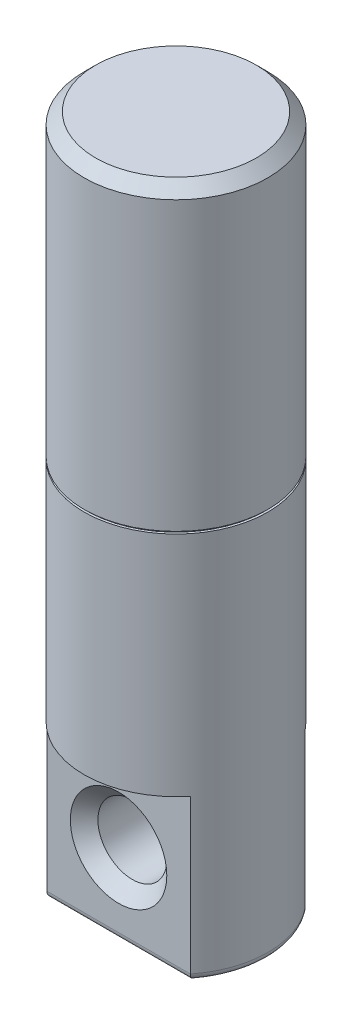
ISO-10303-21;
HEADER;
FILE_DESCRIPTION(('STEP AP214'),'2;1');
FILE_NAME('part.step','',(''),(''),'','','');
FILE_SCHEMA(('AUTOMOTIVE_DESIGN { 1 0 10303 214 1 1 1 1 }'));
ENDSEC;
DATA;
#1=APPLICATION_CONTEXT('core data for automotive mechanical design processes');
#2=APPLICATION_PROTOCOL_DEFINITION('international standard','automotive_design',2000,#1);
#3=PRODUCT_CONTEXT('',#1,'mechanical');
#4=PRODUCT('Part','Part','',(#3));
#5=PRODUCT_RELATED_PRODUCT_CATEGORY('part','',(#4));
#6=PRODUCT_DEFINITION_FORMATION('','',#4);
#7=PRODUCT_DEFINITION_CONTEXT('part definition',#1,'design');
#8=PRODUCT_DEFINITION('design','',#6,#7);
#9=PRODUCT_DEFINITION_SHAPE('','',#8);
#10=(LENGTH_UNIT() NAMED_UNIT(*) SI_UNIT(.MILLI.,.METRE.));
#11=(NAMED_UNIT(*) PLANE_ANGLE_UNIT() SI_UNIT($,.RADIAN.));
#12=(NAMED_UNIT(*) SI_UNIT($,.STERADIAN.) SOLID_ANGLE_UNIT());
#13=UNCERTAINTY_MEASURE_WITH_UNIT(LENGTH_MEASURE(1.E-05),#10,'distance_accuracy_value','');
#14=(GEOMETRIC_REPRESENTATION_CONTEXT(3) GLOBAL_UNCERTAINTY_ASSIGNED_CONTEXT((#13)) GLOBAL_UNIT_ASSIGNED_CONTEXT((#10,
#11,#12)) REPRESENTATION_CONTEXT('',''));
#15=CARTESIAN_POINT('',(0.,0.,0.));
#16=DIRECTION('',(0.,0.,1.));
#17=DIRECTION('',(1.,0.,0.));
#18=AXIS2_PLACEMENT_3D('',#15,#16,#17);
#19=CARTESIAN_POINT('',(0.,15.,0.));
#20=DIRECTION('',(0.,-1.,0.));
#21=DIRECTION('',(0.,0.,-1.));
#22=AXIS2_PLACEMENT_3D('',#19,#20,#21);
#23=CYLINDRICAL_SURFACE('',#22,2.);
#24=CARTESIAN_POINT('',(0.,8.5,0.));
#25=DIRECTION('',(0.,1.,0.));
#26=DIRECTION('',(0.,0.,1.));
#27=AXIS2_PLACEMENT_3D('',#24,#25,#26);
#28=CIRCLE('',#27,2.);
#29=CARTESIAN_POINT('',(0.,8.5,1.99999999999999));
#30=VERTEX_POINT('',#29);
#31=EDGE_CURVE('E124',#30,#30,#28,.T.);
#32=ORIENTED_EDGE('',*,*,#31,.T.);
#33=EDGE_LOOP('',(#32));
#34=FACE_BOUND('',#33,.T.);
#35=CARTESIAN_POINT('',(0.,14.75,0.));
#36=DIRECTION('',(0.,1.,0.));
#37=DIRECTION('',(0.,0.,1.));
#38=AXIS2_PLACEMENT_3D('',#35,#36,#37);
#39=CIRCLE('',#38,2.);
#40=CARTESIAN_POINT('',(0.,14.75,2.));
#41=VERTEX_POINT('',#40);
#42=EDGE_CURVE('E120',#41,#41,#39,.F.);
#43=ORIENTED_EDGE('',*,*,#42,.T.);
#44=EDGE_LOOP('',(#43));
#45=FACE_BOUND('',#44,.T.);
#46=ADVANCED_FACE('F32',(#34,#45),#23,.T.);
#47=CARTESIAN_POINT('',(0.,15.,0.));
#48=DIRECTION('',(0.,1.,0.));
#49=DIRECTION('',(0.,0.,1.));
#50=AXIS2_PLACEMENT_3D('',#47,#48,#49);
#51=PLANE('',#50);
#52=CARTESIAN_POINT('',(0.,15.,0.));
#53=DIRECTION('',(0.,1.,0.));
#54=DIRECTION('',(0.,0.,1.));
#55=AXIS2_PLACEMENT_3D('',#52,#53,#54);
#56=CIRCLE('',#55,1.75);
#57=CARTESIAN_POINT('',(0.,15.,1.75));
#58=VERTEX_POINT('',#57);
#59=EDGE_CURVE('E115',#58,#58,#56,.T.);
#60=ORIENTED_EDGE('',*,*,#59,.T.);
#61=EDGE_LOOP('',(#60));
#62=FACE_BOUND('',#61,.T.);
#63=ADVANCED_FACE('F237',(#62),#51,.T.);
#64=CARTESIAN_POINT('',(0.,15.,0.));
#65=DIRECTION('',(0.,-1.,0.));
#66=DIRECTION('',(0.,0.,-1.));
#67=AXIS2_PLACEMENT_3D('',#64,#65,#66);
#68=CONICAL_SURFACE('',#67,1.75,0.785398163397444);
#69=ORIENTED_EDGE('',*,*,#42,.F.);
#70=EDGE_LOOP('',(#69));
#71=FACE_BOUND('',#70,.T.);
#72=ORIENTED_EDGE('',*,*,#59,.F.);
#73=EDGE_LOOP('',(#72));
#74=FACE_BOUND('',#73,.T.);
#75=ADVANCED_FACE('F217',(#71,#74),#68,.T.);
#76=CARTESIAN_POINT('',(1.95,8.45,0.));
#77=DIRECTION('',(0.,-1.,0.));
#78=DIRECTION('',(0.,0.,-1.));
#79=AXIS2_PLACEMENT_3D('',#76,#77,#78);
#80=PLANE('',#79);
#81=CARTESIAN_POINT('',(0.,8.45,0.));
#82=DIRECTION('',(0.,-1.,0.));
#83=DIRECTION('',(0.,0.,-1.));
#84=AXIS2_PLACEMENT_3D('',#81,#82,#83);
#85=CIRCLE('',#84,1.95);
#86=CARTESIAN_POINT('',(0.,8.45,-1.95));
#87=VERTEX_POINT('',#86);
#88=EDGE_CURVE('E127',#87,#87,#85,.T.);
#89=ORIENTED_EDGE('',*,*,#88,.T.);
#90=EDGE_LOOP('',(#89));
#91=FACE_BOUND('',#90,.T.);
#92=CARTESIAN_POINT('',(0.,8.45,0.));
#93=DIRECTION('',(0.,-1.,0.));
#94=DIRECTION('',(0.,0.,-1.));
#95=AXIS2_PLACEMENT_3D('',#92,#93,#94);
#96=CIRCLE('',#95,2.);
#97=CARTESIAN_POINT('',(0.,8.45,-2.));
#98=VERTEX_POINT('',#97);
#99=EDGE_CURVE('E98',#98,#98,#96,.T.);
#100=ORIENTED_EDGE('',*,*,#99,.F.);
#101=EDGE_LOOP('',(#100));
#102=FACE_BOUND('',#101,.T.);
#103=ADVANCED_FACE('F213',(#91,#102),#80,.F.);
#104=CARTESIAN_POINT('',(1.95,8.5,0.));
#105=DIRECTION('',(0.,1.,0.));
#106=DIRECTION('',(0.,0.,1.));
#107=AXIS2_PLACEMENT_3D('',#104,#105,#106);
#108=PLANE('',#107);
#109=CARTESIAN_POINT('',(0.,8.5,0.));
#110=DIRECTION('',(0.,-1.,0.));
#111=DIRECTION('',(0.,0.,-1.));
#112=AXIS2_PLACEMENT_3D('',#109,#110,#111);
#113=CIRCLE('',#112,1.95);
#114=CARTESIAN_POINT('',(0.,8.5,-1.95000000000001));
#115=VERTEX_POINT('',#114);
#116=EDGE_CURVE('E176',#115,#115,#113,.T.);
#117=ORIENTED_EDGE('',*,*,#116,.F.);
#118=EDGE_LOOP('',(#117));
#119=FACE_BOUND('',#118,.T.);
#120=ORIENTED_EDGE('',*,*,#31,.F.);
#121=EDGE_LOOP('',(#120));
#122=FACE_BOUND('',#121,.T.);
#123=ADVANCED_FACE('F209',(#119,#122),#108,.F.);
#124=CARTESIAN_POINT('',(0.,0.,0.));
#125=DIRECTION('',(0.,-1.,0.));
#126=DIRECTION('',(0.,0.,-1.));
#127=AXIS2_PLACEMENT_3D('',#124,#125,#126);
#128=CYLINDRICAL_SURFACE('',#127,1.95);
#129=ORIENTED_EDGE('',*,*,#88,.F.);
#130=EDGE_LOOP('',(#129));
#131=FACE_BOUND('',#130,.T.);
#132=ORIENTED_EDGE('',*,*,#116,.T.);
#133=EDGE_LOOP('',(#132));
#134=FACE_BOUND('',#133,.T.);
#135=ADVANCED_FACE('F212',(#131,#134),#128,.T.);
#136=CARTESIAN_POINT('',(0.,3.5,0.));
#137=DIRECTION('',(0.,-1.,0.));
#138=DIRECTION('',(0.,0.,-1.));
#139=AXIS2_PLACEMENT_3D('',#136,#137,#138);
#140=PLANE('',#139);
#141=CARTESIAN_POINT('',(0.,3.5,0.));
#142=DIRECTION('',(0.,-1.,0.));
#143=DIRECTION('',(0.,0.,-1.));
#144=AXIS2_PLACEMENT_3D('',#141,#142,#143);
#145=CIRCLE('',#144,2.);
#146=CARTESIAN_POINT('',(-1.5612494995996,3.5,-1.25));
#147=VERTEX_POINT('',#146);
#148=CARTESIAN_POINT('',(1.5612494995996,3.5,-1.25));
#149=VERTEX_POINT('',#148);
#150=EDGE_CURVE('E105',#147,#149,#145,.T.);
#151=ORIENTED_EDGE('',*,*,#150,.T.);
#152=DIRECTION('',(-1.,0.,0.));
#153=VECTOR('',#152,1.);
#154=CARTESIAN_POINT('',(1.5612494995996,3.5,-1.25));
#155=LINE('',#154,#153);
#156=EDGE_CURVE('E109',#149,#147,#155,.T.);
#157=ORIENTED_EDGE('',*,*,#156,.T.);
#158=EDGE_LOOP('',(#151,#157));
#159=FACE_BOUND('',#158,.T.);
#160=ADVANCED_FACE('F221',(#159),#140,.T.);
#161=CARTESIAN_POINT('',(1.5612494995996,3.5,-1.25));
#162=DIRECTION('',(0.,0.,1.));
#163=DIRECTION('',(1.,0.,0.));
#164=AXIS2_PLACEMENT_3D('',#161,#162,#163);
#165=PLANE('',#164);
#166=CARTESIAN_POINT('',(0.,1.75,-1.25));
#167=DIRECTION('',(0.,0.,1.));
#168=DIRECTION('',(1.,0.,0.));
#169=AXIS2_PLACEMENT_3D('',#166,#167,#168);
#170=CIRCLE('',#169,1.05);
#171=CARTESIAN_POINT('',(1.05,1.75,-1.25));
#172=VERTEX_POINT('',#171);
#173=EDGE_CURVE('E123',#172,#172,#170,.T.);
#174=ORIENTED_EDGE('',*,*,#173,.T.);
#175=EDGE_LOOP('',(#174));
#176=FACE_BOUND('',#175,.T.);
#177=DIRECTION('',(0.,-1.,0.));
#178=VECTOR('',#177,1.);
#179=CARTESIAN_POINT('',(1.5612494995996,3.5,-1.25));
#180=LINE('',#179,#178);
#181=CARTESIAN_POINT('',(1.5612494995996,0.149999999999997,-1.25));
#182=VERTEX_POINT('',#181);
#183=EDGE_CURVE('E112',#149,#182,#180,.T.);
#184=ORIENTED_EDGE('',*,*,#183,.T.);
#185=DIRECTION('',(-1.,0.,0.));
#186=VECTOR('',#185,1.);
#187=CARTESIAN_POINT('',(1.5612494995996,0.149999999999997,-1.25));
#188=LINE('',#187,#186);
#189=CARTESIAN_POINT('',(-1.5612494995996,0.149999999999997,-1.25));
#190=VERTEX_POINT('',#189);
#191=EDGE_CURVE('E39',#182,#190,#188,.T.);
#192=ORIENTED_EDGE('',*,*,#191,.T.);
#193=DIRECTION('',(0.,-1.,0.));
#194=VECTOR('',#193,1.);
#195=CARTESIAN_POINT('',(-1.5612494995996,3.5,-1.25));
#196=LINE('',#195,#194);
#197=EDGE_CURVE('E113',#147,#190,#196,.T.);
#198=ORIENTED_EDGE('',*,*,#197,.F.);
#199=ORIENTED_EDGE('',*,*,#156,.F.);
#200=EDGE_LOOP('',(#184,#192,#198,#199));
#201=FACE_BOUND('',#200,.T.);
#202=ADVANCED_FACE('F152',(#176,#201),#165,.F.);
#203=CARTESIAN_POINT('',(0.,0.,0.));
#204=DIRECTION('',(0.,1.,0.));
#205=DIRECTION('',(0.,0.,1.));
#206=AXIS2_PLACEMENT_3D('',#203,#204,#205);
#207=PLANE('',#206);
#208=DIRECTION('',(-1.,0.,0.));
#209=VECTOR('',#208,1.);
#210=CARTESIAN_POINT('',(-1.5612494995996,0.,1.09999999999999));
#211=LINE('',#210,#209);
#212=CARTESIAN_POINT('',(1.48744747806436,0.,1.1));
#213=VERTEX_POINT('',#212);
#214=CARTESIAN_POINT('',(-1.48744747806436,0.,1.1));
#215=VERTEX_POINT('',#214);
#216=EDGE_CURVE('E144',#213,#215,#211,.T.);
#217=ORIENTED_EDGE('',*,*,#216,.T.);
#218=CARTESIAN_POINT('',(0.,0.,0.));
#219=DIRECTION('',(0.,1.,0.));
#220=DIRECTION('',(0.,0.,1.));
#221=AXIS2_PLACEMENT_3D('',#218,#219,#220);
#222=CIRCLE('',#221,1.85);
#223=CARTESIAN_POINT('',(-1.48744747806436,0.,-1.1));
#224=VERTEX_POINT('',#223);
#225=EDGE_CURVE('E149',#215,#224,#222,.F.);
#226=ORIENTED_EDGE('',*,*,#225,.T.);
#227=DIRECTION('',(-1.,0.,0.));
#228=VECTOR('',#227,1.);
#229=CARTESIAN_POINT('',(0.,0.,-1.1));
#230=LINE('',#229,#228);
#231=CARTESIAN_POINT('',(1.48744747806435,0.,-1.09999999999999));
#232=VERTEX_POINT('',#231);
#233=EDGE_CURVE('E53',#224,#232,#230,.F.);
#234=ORIENTED_EDGE('',*,*,#233,.T.);
#235=CARTESIAN_POINT('',(0.,0.,0.));
#236=DIRECTION('',(0.,1.,0.));
#237=DIRECTION('',(0.,0.,1.));
#238=AXIS2_PLACEMENT_3D('',#235,#236,#237);
#239=CIRCLE('',#238,1.85);
#240=EDGE_CURVE('E146',#232,#213,#239,.F.);
#241=ORIENTED_EDGE('',*,*,#240,.T.);
#242=EDGE_LOOP('',(#217,#226,#234,#241));
#243=FACE_BOUND('',#242,.T.);
#244=ADVANCED_FACE('F225',(#243),#207,.F.);
#245=CARTESIAN_POINT('',(0.,3.5,0.));
#246=DIRECTION('',(0.,-1.,0.));
#247=DIRECTION('',(0.,0.,1.));
#248=AXIS2_PLACEMENT_3D('',#245,#246,#247);
#249=PLANE('',#248);
#250=CARTESIAN_POINT('',(0.,3.5,0.));
#251=DIRECTION('',(0.,1.,0.));
#252=DIRECTION('',(0.,0.,1.));
#253=AXIS2_PLACEMENT_3D('',#250,#251,#252);
#254=CIRCLE('',#253,2.);
#255=CARTESIAN_POINT('',(-1.56124949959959,3.5,1.25));
#256=VERTEX_POINT('',#255);
#257=CARTESIAN_POINT('',(1.5612494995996,3.5,1.25000000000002));
#258=VERTEX_POINT('',#257);
#259=EDGE_CURVE('E94',#256,#258,#254,.T.);
#260=ORIENTED_EDGE('',*,*,#259,.F.);
#261=DIRECTION('',(-1.,0.,0.));
#262=VECTOR('',#261,1.);
#263=CARTESIAN_POINT('',(1.5612494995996,3.5,1.25000000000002));
#264=LINE('',#263,#262);
#265=EDGE_CURVE('E85',#258,#256,#264,.T.);
#266=ORIENTED_EDGE('',*,*,#265,.F.);
#267=EDGE_LOOP('',(#260,#266));
#268=FACE_BOUND('',#267,.T.);
#269=ADVANCED_FACE('F96',(#268),#249,.T.);
#270=CARTESIAN_POINT('',(1.5612494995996,3.5,1.25000000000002));
#271=DIRECTION('',(0.,0.,1.));
#272=DIRECTION('',(1.,0.,0.));
#273=AXIS2_PLACEMENT_3D('',#270,#271,#272);
#274=PLANE('',#273);
#275=CARTESIAN_POINT('',(0.,1.75,1.25));
#276=DIRECTION('',(0.,0.,1.));
#277=DIRECTION('',(1.,0.,0.));
#278=AXIS2_PLACEMENT_3D('',#275,#276,#277);
#279=CIRCLE('',#278,1.05);
#280=CARTESIAN_POINT('',(1.05,1.75,1.25));
#281=VERTEX_POINT('',#280);
#282=EDGE_CURVE('E138',#281,#281,#279,.F.);
#283=ORIENTED_EDGE('',*,*,#282,.T.);
#284=EDGE_LOOP('',(#283));
#285=FACE_BOUND('',#284,.T.);
#286=DIRECTION('',(0.,-1.,0.));
#287=VECTOR('',#286,1.);
#288=CARTESIAN_POINT('',(-1.56124949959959,3.5,1.25));
#289=LINE('',#288,#287);
#290=CARTESIAN_POINT('',(-1.5612494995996,0.149999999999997,1.25));
#291=VERTEX_POINT('',#290);
#292=EDGE_CURVE('E89',#256,#291,#289,.T.);
#293=ORIENTED_EDGE('',*,*,#292,.T.);
#294=DIRECTION('',(-1.,0.,0.));
#295=VECTOR('',#294,1.);
#296=CARTESIAN_POINT('',(1.5612494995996,0.150000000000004,1.25));
#297=LINE('',#296,#295);
#298=CARTESIAN_POINT('',(1.5612494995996,0.150000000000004,1.25));
#299=VERTEX_POINT('',#298);
#300=EDGE_CURVE('E11',#291,#299,#297,.F.);
#301=ORIENTED_EDGE('',*,*,#300,.T.);
#302=DIRECTION('',(0.,-1.,0.));
#303=VECTOR('',#302,1.);
#304=CARTESIAN_POINT('',(1.5612494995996,3.5,1.25000000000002));
#305=LINE('',#304,#303);
#306=EDGE_CURVE('E91',#258,#299,#305,.T.);
#307=ORIENTED_EDGE('',*,*,#306,.F.);
#308=ORIENTED_EDGE('',*,*,#265,.T.);
#309=EDGE_LOOP('',(#293,#301,#307,#308));
#310=FACE_BOUND('',#309,.T.);
#311=ADVANCED_FACE('F87',(#285,#310),#274,.T.);
#312=ORIENTED_EDGE('',*,*,#99,.T.);
#313=EDGE_LOOP('',(#312));
#314=FACE_BOUND('',#313,.T.);
#315=ORIENTED_EDGE('',*,*,#197,.T.);
#316=CARTESIAN_POINT('',(0.,0.150000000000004,0.));
#317=DIRECTION('',(0.,1.,0.));
#318=DIRECTION('',(0.,0.,1.));
#319=AXIS2_PLACEMENT_3D('',#316,#317,#318);
#320=CIRCLE('',#319,2.);
#321=EDGE_CURVE('E103',#190,#291,#320,.T.);
#322=ORIENTED_EDGE('',*,*,#321,.T.);
#323=ORIENTED_EDGE('',*,*,#292,.F.);
#324=ORIENTED_EDGE('',*,*,#259,.T.);
#325=ORIENTED_EDGE('',*,*,#306,.T.);
#326=CARTESIAN_POINT('',(0.,0.150000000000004,0.));
#327=DIRECTION('',(0.,1.,0.));
#328=DIRECTION('',(0.,0.,1.));
#329=AXIS2_PLACEMENT_3D('',#326,#327,#328);
#330=CIRCLE('',#329,2.);
#331=EDGE_CURVE('E141',#299,#182,#330,.T.);
#332=ORIENTED_EDGE('',*,*,#331,.T.);
#333=ORIENTED_EDGE('',*,*,#183,.F.);
#334=ORIENTED_EDGE('',*,*,#150,.F.);
#335=EDGE_LOOP('',(#315,#322,#323,#324,#325,#332,#333,#334));
#336=FACE_BOUND('',#335,.T.);
#337=ADVANCED_FACE('F102',(#314,#336),#23,.T.);
#338=CARTESIAN_POINT('',(0.,1.74999999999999,-2.));
#339=DIRECTION('',(0.,0.,1.));
#340=DIRECTION('',(1.,0.,0.));
#341=AXIS2_PLACEMENT_3D('',#338,#339,#340);
#342=CYLINDRICAL_SURFACE('',#341,0.75);
#343=CARTESIAN_POINT('',(0.,1.75,-0.949999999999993));
#344=DIRECTION('',(0.,0.,1.));
#345=DIRECTION('',(1.,0.,0.));
#346=AXIS2_PLACEMENT_3D('',#343,#344,#345);
#347=CIRCLE('',#346,0.75);
#348=CARTESIAN_POINT('',(0.75,1.75,-0.949999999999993));
#349=VERTEX_POINT('',#348);
#350=EDGE_CURVE('E135',#349,#349,#347,.F.);
#351=ORIENTED_EDGE('',*,*,#350,.T.);
#352=EDGE_LOOP('',(#351));
#353=FACE_BOUND('',#352,.T.);
#354=CARTESIAN_POINT('',(0.,1.75,0.950000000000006));
#355=DIRECTION('',(0.,0.,1.));
#356=DIRECTION('',(1.,0.,0.));
#357=AXIS2_PLACEMENT_3D('',#354,#355,#356);
#358=CIRCLE('',#357,0.75);
#359=CARTESIAN_POINT('',(0.749999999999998,1.75,0.950000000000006));
#360=VERTEX_POINT('',#359);
#361=EDGE_CURVE('E132',#360,#360,#358,.T.);
#362=ORIENTED_EDGE('',*,*,#361,.T.);
#363=EDGE_LOOP('',(#362));
#364=FACE_BOUND('',#363,.T.);
#365=ADVANCED_FACE('F204',(#353,#364),#342,.F.);
#366=CARTESIAN_POINT('',(0.,1.75,-1.25));
#367=DIRECTION('',(0.,0.,-1.));
#368=DIRECTION('',(-1.,0.,0.));
#369=AXIS2_PLACEMENT_3D('',#366,#367,#368);
#370=CONICAL_SURFACE('',#369,1.05,0.785398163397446);
#371=ORIENTED_EDGE('',*,*,#350,.F.);
#372=EDGE_LOOP('',(#371));
#373=FACE_BOUND('',#372,.T.);
#374=ORIENTED_EDGE('',*,*,#173,.F.);
#375=EDGE_LOOP('',(#374));
#376=FACE_BOUND('',#375,.T.);
#377=ADVANCED_FACE('F200',(#373,#376),#370,.F.);
#378=CARTESIAN_POINT('',(0.,1.75,0.950000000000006));
#379=DIRECTION('',(0.,0.,1.));
#380=DIRECTION('',(1.,0.,0.));
#381=AXIS2_PLACEMENT_3D('',#378,#379,#380);
#382=CONICAL_SURFACE('',#381,0.75,0.78539816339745);
#383=ORIENTED_EDGE('',*,*,#282,.F.);
#384=EDGE_LOOP('',(#383));
#385=FACE_BOUND('',#384,.T.);
#386=ORIENTED_EDGE('',*,*,#361,.F.);
#387=EDGE_LOOP('',(#386));
#388=FACE_BOUND('',#387,.T.);
#389=ADVANCED_FACE('F196',(#385,#388),#382,.F.);
#390=CARTESIAN_POINT('',(0.,0.150000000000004,0.));
#391=DIRECTION('',(0.,1.,0.));
#392=DIRECTION('',(0.,0.,1.));
#393=AXIS2_PLACEMENT_3D('',#390,#391,#392);
#394=TOROIDAL_SURFACE('',#393,1.85,0.15);
#395=CARTESIAN_POINT('',(1.5612494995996,0.150000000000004,1.25));
#396=CARTESIAN_POINT('',(1.56125369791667,0.14216404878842,1.25000940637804));
#397=CARTESIAN_POINT('',(1.5609548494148,0.134334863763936,1.24938663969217));
#398=CARTESIAN_POINT('',(1.55978445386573,0.118933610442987,1.24695129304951));
#399=CARTESIAN_POINT('',(1.55891481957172,0.111360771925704,1.24514268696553));
#400=CARTESIAN_POINT('',(1.55663637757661,0.0966640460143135,1.24041040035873));
#401=CARTESIAN_POINT('',(1.55522781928,0.0895399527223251,1.23748723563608));
#402=CARTESIAN_POINT('',(1.55192529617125,0.0759073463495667,1.23064625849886));
#403=CARTESIAN_POINT('',(1.55003107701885,0.0693991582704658,1.22672792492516));
#404=CARTESIAN_POINT('',(1.54573919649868,0.0569000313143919,1.21786993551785));
#405=CARTESIAN_POINT('',(1.54332498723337,0.0509385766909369,1.21289682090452));
#406=CARTESIAN_POINT('',(1.53811586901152,0.0399318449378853,1.20219576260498));
#407=CARTESIAN_POINT('',(1.53532084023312,0.0348868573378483,1.19646758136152));
#408=CARTESIAN_POINT('',(1.52914821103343,0.0253550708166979,1.18385591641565));
#409=CARTESIAN_POINT('',(1.52574057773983,0.0209644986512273,1.17691449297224));
#410=CARTESIAN_POINT('',(1.51864923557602,0.0134089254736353,1.1625219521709));
#411=CARTESIAN_POINT('',(1.51496536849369,0.0102446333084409,1.15507054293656));
#412=CARTESIAN_POINT('',(1.5075582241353,0.00526643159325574,1.14014573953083));
#413=CARTESIAN_POINT('',(1.50384211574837,0.00340457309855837,1.13268458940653));
#414=CARTESIAN_POINT('',(1.49631329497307,0.000844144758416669,1.11762624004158));
#415=CARTESIAN_POINT('',(1.492500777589,0.000143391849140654,1.11002932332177));
#416=CARTESIAN_POINT('',(1.48826725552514,6.59843428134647E-06,1.1016261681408));
#417=CARTESIAN_POINT('',(1.48785740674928,-1.35545681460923E-08,1.10081299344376));
#418=CARTESIAN_POINT('',(1.48744747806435,0.,1.1));
#419=B_SPLINE_CURVE_WITH_KNOTS('',3,(#395,#396,#397,#398,#399,#400,#401,#402,#403,#404,#405,
#406,#407,#408,#409,#410,#411,#412,#413,#414,#415,#416,#417,#418),.UNSPECIFIED.,.F.,.F.,(4,2,2,
2,2,2,2,2,2,2,2,4),(0.,0.0234669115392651,0.0468555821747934,0.0702334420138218,
0.0936235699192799,0.117912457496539,0.142209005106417,0.168776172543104,0.195358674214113,
0.220902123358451,0.246397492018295,0.249129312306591),.UNSPECIFIED.);
#420=EDGE_CURVE('E160',#213,#299,#419,.F.);
#421=ORIENTED_EDGE('',*,*,#420,.F.);
#422=ORIENTED_EDGE('',*,*,#240,.F.);
#423=CARTESIAN_POINT('',(1.5612494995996,0.149999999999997,-1.25));
#424=CARTESIAN_POINT('',(1.56125369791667,0.142164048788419,-1.25000940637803));
#425=CARTESIAN_POINT('',(1.5609548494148,0.134334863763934,-1.24938663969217));
#426=CARTESIAN_POINT('',(1.55978445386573,0.118933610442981,-1.24695129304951));
#427=CARTESIAN_POINT('',(1.55891481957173,0.111360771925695,-1.24514268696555));
#428=CARTESIAN_POINT('',(1.55663637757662,0.0966640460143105,-1.24041040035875));
#429=CARTESIAN_POINT('',(1.55522781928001,0.0895399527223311,-1.23748723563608));
#430=CARTESIAN_POINT('',(1.55192529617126,0.0759073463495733,-1.23064625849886));
#431=CARTESIAN_POINT('',(1.55003107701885,0.069399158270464,-1.22672792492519));
#432=CARTESIAN_POINT('',(1.54573919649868,0.0569000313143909,-1.21786993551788));
#433=CARTESIAN_POINT('',(1.54332498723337,0.0509385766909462,-1.21289682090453));
#434=CARTESIAN_POINT('',(1.53811586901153,0.0399318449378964,-1.20219576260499));
#435=CARTESIAN_POINT('',(1.53532084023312,0.0348868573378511,-1.19646758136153));
#436=CARTESIAN_POINT('',(1.52914821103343,0.0253550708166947,-1.18385591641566));
#437=CARTESIAN_POINT('',(1.52574057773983,0.0209644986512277,-1.17691449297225));
#438=CARTESIAN_POINT('',(1.51864923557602,0.0134089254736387,-1.1625219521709));
#439=CARTESIAN_POINT('',(1.51496536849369,0.0102446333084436,-1.15507054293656));
#440=CARTESIAN_POINT('',(1.5075582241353,0.00526643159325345,-1.14014573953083));
#441=CARTESIAN_POINT('',(1.50384211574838,0.00340457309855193,-1.13268458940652));
#442=CARTESIAN_POINT('',(1.49631329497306,0.000844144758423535,-1.11762624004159));
#443=CARTESIAN_POINT('',(1.49250077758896,0.000143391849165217,-1.11002932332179));
#444=CARTESIAN_POINT('',(1.48826725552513,6.59843428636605E-06,-1.1016261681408));
#445=CARTESIAN_POINT('',(1.48785740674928,-1.3554565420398E-08,-1.10081299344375));
#446=CARTESIAN_POINT('',(1.48744747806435,0.,-1.09999999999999));
#447=B_SPLINE_CURVE_WITH_KNOTS('',3,(#423,#424,#425,#426,#427,#428,#429,#430,#431,#432,#433,
#434,#435,#436,#437,#438,#439,#440,#441,#442,#443,#444,#445,#446),.UNSPECIFIED.,.F.,.F.,(4,2,2,
2,2,2,2,2,2,2,2,4),(0.,0.0234669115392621,0.0468555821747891,0.0702334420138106,
0.0936235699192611,0.117912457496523,0.142209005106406,0.168776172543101,0.195358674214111,
0.220902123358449,0.246397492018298,0.249129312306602),.UNSPECIFIED.);
#448=EDGE_CURVE('E175',#182,#232,#447,.T.);
#449=ORIENTED_EDGE('',*,*,#448,.F.);
#450=ORIENTED_EDGE('',*,*,#331,.F.);
#451=EDGE_LOOP('',(#421,#422,#449,#450));
#452=FACE_BOUND('',#451,.T.);
#453=ADVANCED_FACE('F174',(#452),#394,.T.);
#454=CARTESIAN_POINT('',(1.5612494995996,0.149999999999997,-1.1));
#455=DIRECTION('',(-1.,0.,0.));
#456=DIRECTION('',(0.,0.,1.));
#457=AXIS2_PLACEMENT_3D('',#454,#455,#456);
#458=CYLINDRICAL_SURFACE('',#457,0.15);
#459=ORIENTED_EDGE('',*,*,#448,.T.);
#460=ORIENTED_EDGE('',*,*,#233,.F.);
#461=CARTESIAN_POINT('',(-1.5612494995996,0.149999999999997,-1.25));
#462=CARTESIAN_POINT('',(-1.56125369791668,0.142164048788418,-1.25000940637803));
#463=CARTESIAN_POINT('',(-1.56095484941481,0.134334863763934,-1.24938663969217));
#464=CARTESIAN_POINT('',(-1.55978445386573,0.118933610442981,-1.24695129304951));
#465=CARTESIAN_POINT('',(-1.55891481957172,0.111360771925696,-1.24514268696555));
#466=CARTESIAN_POINT('',(-1.55663637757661,0.0966640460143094,-1.24041040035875));
#467=CARTESIAN_POINT('',(-1.55522781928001,0.0895399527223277,-1.23748723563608));
#468=CARTESIAN_POINT('',(-1.55192529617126,0.0759073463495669,-1.23064625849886));
#469=CARTESIAN_POINT('',(-1.55003107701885,0.0693991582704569,-1.22672792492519));
#470=CARTESIAN_POINT('',(-1.54573919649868,0.0569000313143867,-1.21786993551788));
#471=CARTESIAN_POINT('',(-1.54332498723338,0.0509385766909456,-1.21289682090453));
#472=CARTESIAN_POINT('',(-1.53811586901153,0.0399318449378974,-1.20219576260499));
#473=CARTESIAN_POINT('',(-1.53532084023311,0.0348868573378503,-1.19646758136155));
#474=CARTESIAN_POINT('',(-1.52914821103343,0.0253550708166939,-1.18385591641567));
#475=CARTESIAN_POINT('',(-1.52574057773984,0.0209644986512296,-1.17691449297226));
#476=CARTESIAN_POINT('',(-1.51864923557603,0.0134089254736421,-1.16252195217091));
#477=CARTESIAN_POINT('',(-1.51496536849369,0.0102446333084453,-1.15507054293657));
#478=CARTESIAN_POINT('',(-1.5075582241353,0.00526643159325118,-1.14014573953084));
#479=CARTESIAN_POINT('',(-1.50384211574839,0.00340457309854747,-1.13268458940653));
#480=CARTESIAN_POINT('',(-1.49631329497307,0.000844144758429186,-1.11762624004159));
#481=CARTESIAN_POINT('',(-1.49250077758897,0.000143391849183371,-1.11002932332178));
#482=CARTESIAN_POINT('',(-1.48826725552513,6.59843428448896E-06,-1.1016261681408));
#483=CARTESIAN_POINT('',(-1.48785740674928,-1.35545695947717E-08,-1.10081299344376));
#484=CARTESIAN_POINT('',(-1.48744747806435,0.,-1.1));
#485=B_SPLINE_CURVE_WITH_KNOTS('',3,(#461,#462,#463,#464,#465,#466,#467,#468,#469,#470,#471,
#472,#473,#474,#475,#476,#477,#478,#479,#480,#481,#482,#483,#484),.UNSPECIFIED.,.F.,.F.,(4,2,2,
2,2,2,2,2,2,2,2,4),(0.,0.0234669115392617,0.0468555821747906,0.0702334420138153,
0.0936235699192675,0.117912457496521,0.142209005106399,0.168776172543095,0.195358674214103,
0.220902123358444,0.246397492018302,0.249129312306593),.UNSPECIFIED.);
#486=EDGE_CURVE('E46',#190,#224,#485,.T.);
#487=ORIENTED_EDGE('',*,*,#486,.F.);
#488=ORIENTED_EDGE('',*,*,#191,.F.);
#489=EDGE_LOOP('',(#459,#460,#487,#488));
#490=FACE_BOUND('',#489,.T.);
#491=ADVANCED_FACE('F159',(#490),#458,.T.);
#492=CARTESIAN_POINT('',(0.,0.149999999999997,1.1));
#493=DIRECTION('',(1.,0.,0.));
#494=DIRECTION('',(0.,0.,-1.));
#495=AXIS2_PLACEMENT_3D('',#492,#493,#494);
#496=CYLINDRICAL_SURFACE('',#495,0.15);
#497=ORIENTED_EDGE('',*,*,#420,.T.);
#498=ORIENTED_EDGE('',*,*,#300,.F.);
#499=CARTESIAN_POINT('',(-1.5612494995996,0.149999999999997,1.25));
#500=CARTESIAN_POINT('',(-1.56125369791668,0.142164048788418,1.25000940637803));
#501=CARTESIAN_POINT('',(-1.56095484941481,0.134334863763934,1.24938663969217));
#502=CARTESIAN_POINT('',(-1.55978445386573,0.118933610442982,1.24695129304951));
#503=CARTESIAN_POINT('',(-1.55891481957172,0.111360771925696,1.24514268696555));
#504=CARTESIAN_POINT('',(-1.55663637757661,0.0966640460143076,1.24041040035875));
#505=CARTESIAN_POINT('',(-1.55522781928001,0.0895399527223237,1.23748723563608));
#506=CARTESIAN_POINT('',(-1.55192529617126,0.0759073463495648,1.23064625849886));
#507=CARTESIAN_POINT('',(-1.55003107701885,0.0693991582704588,1.22672792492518));
#508=CARTESIAN_POINT('',(-1.54573919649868,0.0569000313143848,1.21786993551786));
#509=CARTESIAN_POINT('',(-1.54332498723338,0.0509385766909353,1.21289682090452));
#510=CARTESIAN_POINT('',(-1.53811586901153,0.0399318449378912,1.20219576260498));
#511=CARTESIAN_POINT('',(-1.53532084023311,0.0348868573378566,1.19646758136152));
#512=CARTESIAN_POINT('',(-1.52914821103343,0.0253550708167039,1.18385591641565));
#513=CARTESIAN_POINT('',(-1.52574057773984,0.0209644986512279,1.17691449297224));
#514=CARTESIAN_POINT('',(-1.51864923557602,0.0134089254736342,1.16252195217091));
#515=CARTESIAN_POINT('',(-1.51496536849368,0.010244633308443,1.15507054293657));
#516=CARTESIAN_POINT('',(-1.50755822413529,0.0052664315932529,1.14014573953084));
#517=CARTESIAN_POINT('',(-1.50384211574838,0.00340457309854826,1.13268458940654));
#518=CARTESIAN_POINT('',(-1.49631329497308,0.000844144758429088,1.11762624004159));
#519=CARTESIAN_POINT('',(-1.49250077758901,0.000143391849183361,1.11002932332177));
#520=CARTESIAN_POINT('',(-1.48826725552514,6.59843428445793E-06,1.1016261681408));
#521=CARTESIAN_POINT('',(-1.48785740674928,-1.35545696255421E-08,1.10081299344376));
#522=CARTESIAN_POINT('',(-1.48744747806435,0.,1.1));
#523=B_SPLINE_CURVE_WITH_KNOTS('',3,(#499,#500,#501,#502,#503,#504,#505,#506,#507,#508,#509,
#510,#511,#512,#513,#514,#515,#516,#517,#518,#519,#520,#521,#522),.UNSPECIFIED.,.F.,.F.,(4,2,2,
2,2,2,2,2,2,2,2,4),(0.,0.0234669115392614,0.0468555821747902,0.0702334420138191,
0.0936235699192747,0.117912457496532,0.142209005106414,0.168776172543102,0.1953586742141,
0.220902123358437,0.246397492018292,0.249129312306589),.UNSPECIFIED.);
#524=EDGE_CURVE('E161',#215,#291,#523,.F.);
#525=ORIENTED_EDGE('',*,*,#524,.F.);
#526=ORIENTED_EDGE('',*,*,#216,.F.);
#527=EDGE_LOOP('',(#497,#498,#525,#526));
#528=FACE_BOUND('',#527,.T.);
#529=ADVANCED_FACE('F170',(#528),#496,.T.);
#530=CARTESIAN_POINT('',(0.,0.150000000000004,0.));
#531=DIRECTION('',(0.,1.,0.));
#532=DIRECTION('',(0.,0.,1.));
#533=AXIS2_PLACEMENT_3D('',#530,#531,#532);
#534=TOROIDAL_SURFACE('',#533,1.85,0.15);
#535=ORIENTED_EDGE('',*,*,#486,.T.);
#536=ORIENTED_EDGE('',*,*,#225,.F.);
#537=ORIENTED_EDGE('',*,*,#524,.T.);
#538=ORIENTED_EDGE('',*,*,#321,.F.);
#539=EDGE_LOOP('',(#535,#536,#537,#538));
#540=FACE_BOUND('',#539,.T.);
#541=ADVANCED_FACE('F163',(#540),#534,.T.);
#542=CLOSED_SHELL('',(#46,#63,#75,#103,#123,#135,#160,#202,#244,#269,#311,#337,#365,#377,#389,
#453,#491,#529,#541));
#543=MANIFOLD_SOLID_BREP('B2',#542);
#544=ADVANCED_BREP_SHAPE_REPRESENTATION('',(#18,#543),#14);
#545=SHAPE_DEFINITION_REPRESENTATION(#9,#544);
ENDSEC;
END-ISO-10303-21;
